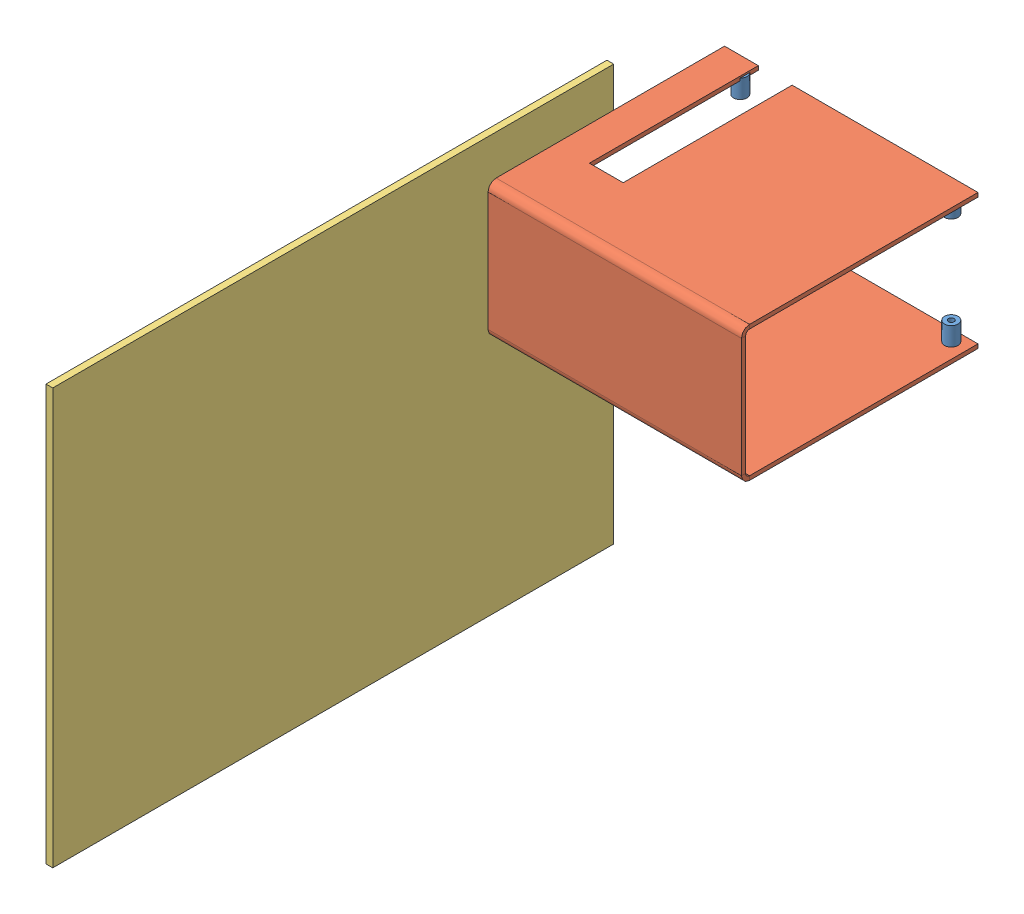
SolidWorks assembly CDE33341.SLDASM, configuration Défaut (file format 3400). Lengths in mm.
Overall size (385 615 994).
6 component instances, 3 part files, 8 mates.
Components (placement in the parent):
- 1105-8.5 (27.5)-1: 1105-8.5 (27.5).SLDPRT [Défaut] at (43.1212 375.75 -144.1347) x (0.638249 0 -0.76983) z (0 -1 0) size (20 20 27.5)
- 1105-8.5 (27.5)-2: 1105-8.5 (27.5).SLDPRT [Défaut] at (352.3865 375.75 -147.1055) x (0.385646 0 0.922647) z (0 1 0) size (20 20 27.5)
- CD033342-1: CD033342.SLDPRT [Défaut] at (375 556 -164) x (0 -1 0) z (-1 0 0) size (200 350 375)
- CD033343-1: CD033343.SLDPRT [Défaut] at (-10 0 0) x (0 1 0) z (1 0 0) size (615 830 10)
- 1105-8.5 (27.5)-3: 1105-8.5 (27.5).SLDPRT [Défaut] at (43.1212 539.75 -144.1347) x (0.638249 0 -0.76983) z (0 -1 0) size (20 20 27.5)
- 1105-8.5 (27.5)-4: 1105-8.5 (27.5).SLDPRT [Défaut] at (352.3865 539.75 -147.1055) x (0.385646 0 0.922647) z (0 1 0) size (20 20 27.5)
Mates (geometry in assembly coordinates):
- Coïncidente29: coincident aligned: plane of CD033343-1 through (0 0 830) normal (1 0 0)
- Coïncidente30: coincident anti-aligned: unknown of CD033343-1
- Coïncidente31: coincident anti-aligned: plane of CD033343-1 through (0 0 830) normal (1 0 0); plane of CD033342-1 through (0 550 174) normal (-1 0 0)
- Coïncidente38: coincident aligned: plane of 1105-8.5 (27.5)-1 through (43.1212 362 -144.1347) normal (0 -1 0); plane of 1105-8.5 (27.5)-2 through (352.3865 362 -147.1055) normal (0 -1 0)
- Coïncidente39: coincident anti-aligned: plane of 1105-8.5 (27.5)-1 through (43.1212 362 -144.1347) normal (0 -1 0); plane of CD033342-1 through (0 362 186) normal (0 1 0)
- Coïncidente40: coincident anti-aligned: unknown of CD033343-1
- Coïncidente41: coincident aligned: plane of CD033343-1 through (0 360 180) normal (0 0 -1); plane of CD033342-1 through (0 556 180) normal (0 0 -1)
- Coïncidente42: coincident aligned: unknown of CD033343-1; unknown of CD033342-1
